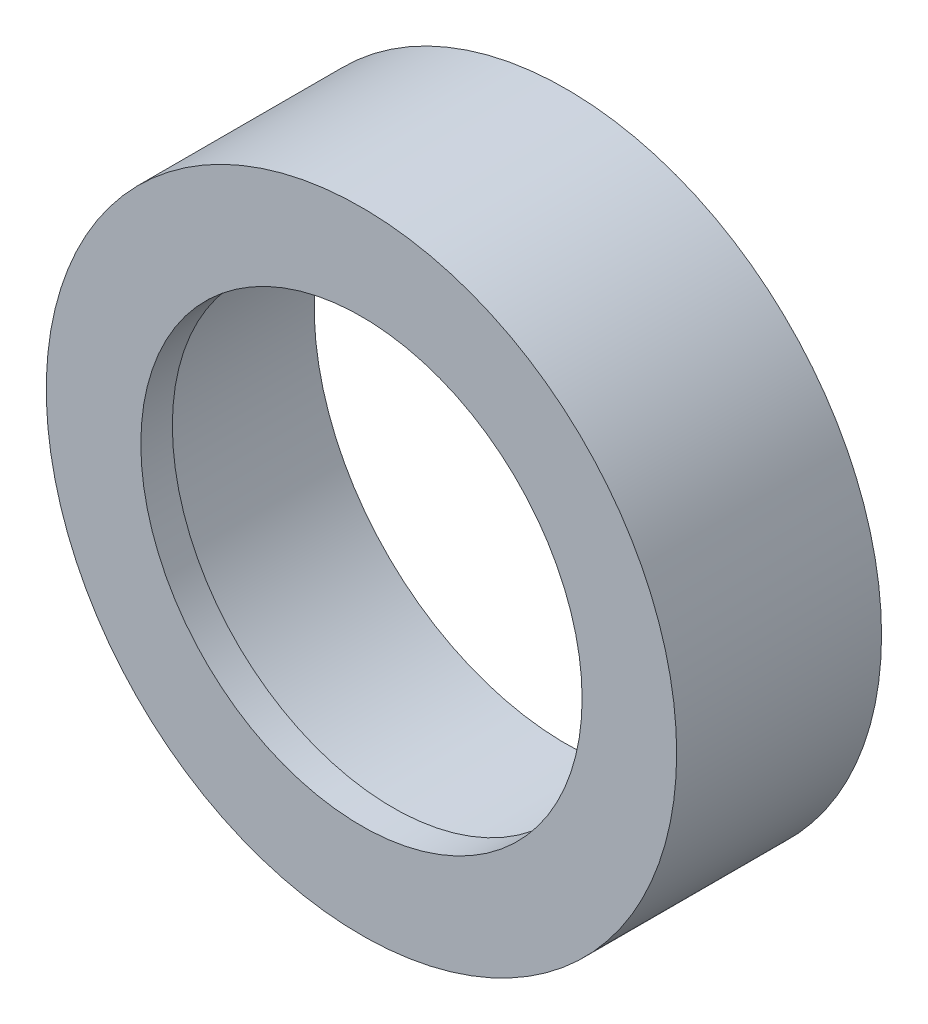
ISO-10303-21;
HEADER;
FILE_DESCRIPTION(('STEP AP214'),'2;1');
FILE_NAME('part.step','',(''),(''),'','','');
FILE_SCHEMA(('AUTOMOTIVE_DESIGN { 1 0 10303 214 1 1 1 1 }'));
ENDSEC;
DATA;
#1=APPLICATION_CONTEXT('core data for automotive mechanical design processes');
#2=APPLICATION_PROTOCOL_DEFINITION('international standard','automotive_design',2000,#1);
#3=PRODUCT_CONTEXT('',#1,'mechanical');
#4=PRODUCT('Part','Part','',(#3));
#5=PRODUCT_RELATED_PRODUCT_CATEGORY('part','',(#4));
#6=PRODUCT_DEFINITION_FORMATION('','',#4);
#7=PRODUCT_DEFINITION_CONTEXT('part definition',#1,'design');
#8=PRODUCT_DEFINITION('design','',#6,#7);
#9=PRODUCT_DEFINITION_SHAPE('','',#8);
#10=(LENGTH_UNIT() NAMED_UNIT(*) SI_UNIT(.MILLI.,.METRE.));
#11=(NAMED_UNIT(*) PLANE_ANGLE_UNIT() SI_UNIT($,.RADIAN.));
#12=(NAMED_UNIT(*) SI_UNIT($,.STERADIAN.) SOLID_ANGLE_UNIT());
#13=UNCERTAINTY_MEASURE_WITH_UNIT(LENGTH_MEASURE(1.E-05),#10,'distance_accuracy_value','');
#14=(GEOMETRIC_REPRESENTATION_CONTEXT(3) GLOBAL_UNCERTAINTY_ASSIGNED_CONTEXT((#13)) GLOBAL_UNIT_ASSIGNED_CONTEXT((#10,
#11,#12)) REPRESENTATION_CONTEXT('',''));
#15=CARTESIAN_POINT('',(0.,0.,0.));
#16=DIRECTION('',(0.,0.,1.));
#17=DIRECTION('',(1.,0.,0.));
#18=AXIS2_PLACEMENT_3D('',#15,#16,#17);
#19=CARTESIAN_POINT('',(0.,0.,1.17961196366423E-13));
#20=DIRECTION('',(0.,0.,1.));
#21=DIRECTION('',(1.,0.,0.));
#22=AXIS2_PLACEMENT_3D('',#19,#20,#21);
#23=CYLINDRICAL_SURFACE('',#22,20.);
#24=CARTESIAN_POINT('',(0.,0.,1.17961196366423E-13));
#25=DIRECTION('',(0.,0.,1.));
#26=DIRECTION('',(1.,0.,0.));
#27=AXIS2_PLACEMENT_3D('',#24,#25,#26);
#28=CIRCLE('',#27,20.);
#29=CARTESIAN_POINT('',(20.0000000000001,0.,1.17961196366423E-13));
#30=VERTEX_POINT('',#29);
#31=EDGE_CURVE('E64',#30,#30,#28,.T.);
#32=ORIENTED_EDGE('',*,*,#31,.F.);
#33=EDGE_LOOP('',(#32));
#34=FACE_BOUND('',#33,.T.);
#35=CARTESIAN_POINT('',(0.,0.,-12.9999999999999));
#36=DIRECTION('',(0.,0.,1.));
#37=DIRECTION('',(1.,0.,0.));
#38=AXIS2_PLACEMENT_3D('',#35,#36,#37);
#39=CIRCLE('',#38,20.);
#40=CARTESIAN_POINT('',(20.0000000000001,0.,-12.9999999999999));
#41=VERTEX_POINT('',#40);
#42=EDGE_CURVE('E10',#41,#41,#39,.T.);
#43=ORIENTED_EDGE('',*,*,#42,.T.);
#44=EDGE_LOOP('',(#43));
#45=FACE_BOUND('',#44,.T.);
#46=ADVANCED_FACE('F36',(#34,#45),#23,.T.);
#47=CARTESIAN_POINT('',(0.,20.0000000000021,-13.));
#48=DIRECTION('',(0.,0.,1.));
#49=DIRECTION('',(1.,0.,0.));
#50=AXIS2_PLACEMENT_3D('',#47,#48,#49);
#51=PLANE('',#50);
#52=ORIENTED_EDGE('',*,*,#42,.F.);
#53=EDGE_LOOP('',(#52));
#54=FACE_BOUND('',#53,.T.);
#55=CARTESIAN_POINT('',(0.,0.,-12.9999999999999));
#56=DIRECTION('',(0.,0.,1.));
#57=DIRECTION('',(1.,0.,0.));
#58=AXIS2_PLACEMENT_3D('',#55,#56,#57);
#59=CIRCLE('',#58,16.);
#60=CARTESIAN_POINT('',(16.0000000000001,0.,-12.9999999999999));
#61=VERTEX_POINT('',#60);
#62=EDGE_CURVE('E43',#61,#61,#59,.T.);
#63=ORIENTED_EDGE('',*,*,#62,.T.);
#64=EDGE_LOOP('',(#63));
#65=FACE_BOUND('',#64,.T.);
#66=ADVANCED_FACE('F71',(#54,#65),#51,.F.);
#67=CARTESIAN_POINT('',(0.,0.,1.17961196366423E-13));
#68=DIRECTION('',(0.,0.,1.));
#69=DIRECTION('',(1.,0.,0.));
#70=AXIS2_PLACEMENT_3D('',#67,#68,#69);
#71=CYLINDRICAL_SURFACE('',#70,16.);
#72=ORIENTED_EDGE('',*,*,#62,.F.);
#73=EDGE_LOOP('',(#72));
#74=FACE_BOUND('',#73,.T.);
#75=CARTESIAN_POINT('',(0.,0.,-1.99999999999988));
#76=DIRECTION('',(0.,0.,1.));
#77=DIRECTION('',(1.,0.,0.));
#78=AXIS2_PLACEMENT_3D('',#75,#76,#77);
#79=CIRCLE('',#78,16.);
#80=CARTESIAN_POINT('',(16.0000000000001,0.,-1.99999999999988));
#81=VERTEX_POINT('',#80);
#82=EDGE_CURVE('E48',#81,#81,#79,.T.);
#83=ORIENTED_EDGE('',*,*,#82,.T.);
#84=EDGE_LOOP('',(#83));
#85=FACE_BOUND('',#84,.T.);
#86=ADVANCED_FACE('F75',(#74,#85),#71,.F.);
#87=CARTESIAN_POINT('',(4.9960036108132E-13,15.999999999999,-2.));
#88=DIRECTION('',(0.,0.,1.));
#89=DIRECTION('',(1.,0.,0.));
#90=AXIS2_PLACEMENT_3D('',#87,#88,#89);
#91=PLANE('',#90);
#92=ORIENTED_EDGE('',*,*,#82,.F.);
#93=EDGE_LOOP('',(#92));
#94=FACE_BOUND('',#93,.T.);
#95=CARTESIAN_POINT('',(0.,0.,-1.99999999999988));
#96=DIRECTION('',(0.,0.,1.));
#97=DIRECTION('',(1.,0.,0.));
#98=AXIS2_PLACEMENT_3D('',#95,#96,#97);
#99=CIRCLE('',#98,14.);
#100=CARTESIAN_POINT('',(14.0000000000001,0.,-1.99999999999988));
#101=VERTEX_POINT('',#100);
#102=EDGE_CURVE('E54',#101,#101,#99,.T.);
#103=ORIENTED_EDGE('',*,*,#102,.T.);
#104=EDGE_LOOP('',(#103));
#105=FACE_BOUND('',#104,.T.);
#106=ADVANCED_FACE('F80',(#94,#105),#91,.F.);
#107=CARTESIAN_POINT('',(0.,0.,1.17961196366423E-13));
#108=DIRECTION('',(0.,0.,1.));
#109=DIRECTION('',(1.,0.,0.));
#110=AXIS2_PLACEMENT_3D('',#107,#108,#109);
#111=CYLINDRICAL_SURFACE('',#110,14.);
#112=ORIENTED_EDGE('',*,*,#102,.F.);
#113=EDGE_LOOP('',(#112));
#114=FACE_BOUND('',#113,.T.);
#115=CARTESIAN_POINT('',(0.,0.,1.17961196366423E-13));
#116=DIRECTION('',(0.,0.,1.));
#117=DIRECTION('',(1.,0.,0.));
#118=AXIS2_PLACEMENT_3D('',#115,#116,#117);
#119=CIRCLE('',#118,14.);
#120=CARTESIAN_POINT('',(14.0000000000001,0.,1.17961196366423E-13));
#121=VERTEX_POINT('',#120);
#122=EDGE_CURVE('E60',#121,#121,#119,.T.);
#123=ORIENTED_EDGE('',*,*,#122,.T.);
#124=EDGE_LOOP('',(#123));
#125=FACE_BOUND('',#124,.T.);
#126=ADVANCED_FACE('F86',(#114,#125),#111,.F.);
#127=CARTESIAN_POINT('',(1.11022302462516E-13,14.000000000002,1.17961196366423E-13));
#128=DIRECTION('',(0.,0.,-1.));
#129=DIRECTION('',(-1.,0.,0.));
#130=AXIS2_PLACEMENT_3D('',#127,#128,#129);
#131=PLANE('',#130);
#132=ORIENTED_EDGE('',*,*,#122,.F.);
#133=EDGE_LOOP('',(#132));
#134=FACE_BOUND('',#133,.T.);
#135=ORIENTED_EDGE('',*,*,#31,.T.);
#136=EDGE_LOOP('',(#135));
#137=FACE_BOUND('',#136,.T.);
#138=ADVANCED_FACE('F68',(#134,#137),#131,.F.);
#139=CLOSED_SHELL('',(#46,#66,#86,#106,#126,#138));
#140=MANIFOLD_SOLID_BREP('B2',#139);
#141=ADVANCED_BREP_SHAPE_REPRESENTATION('',(#18,#140),#14);
#142=SHAPE_DEFINITION_REPRESENTATION(#9,#141);
ENDSEC;
END-ISO-10303-21;
